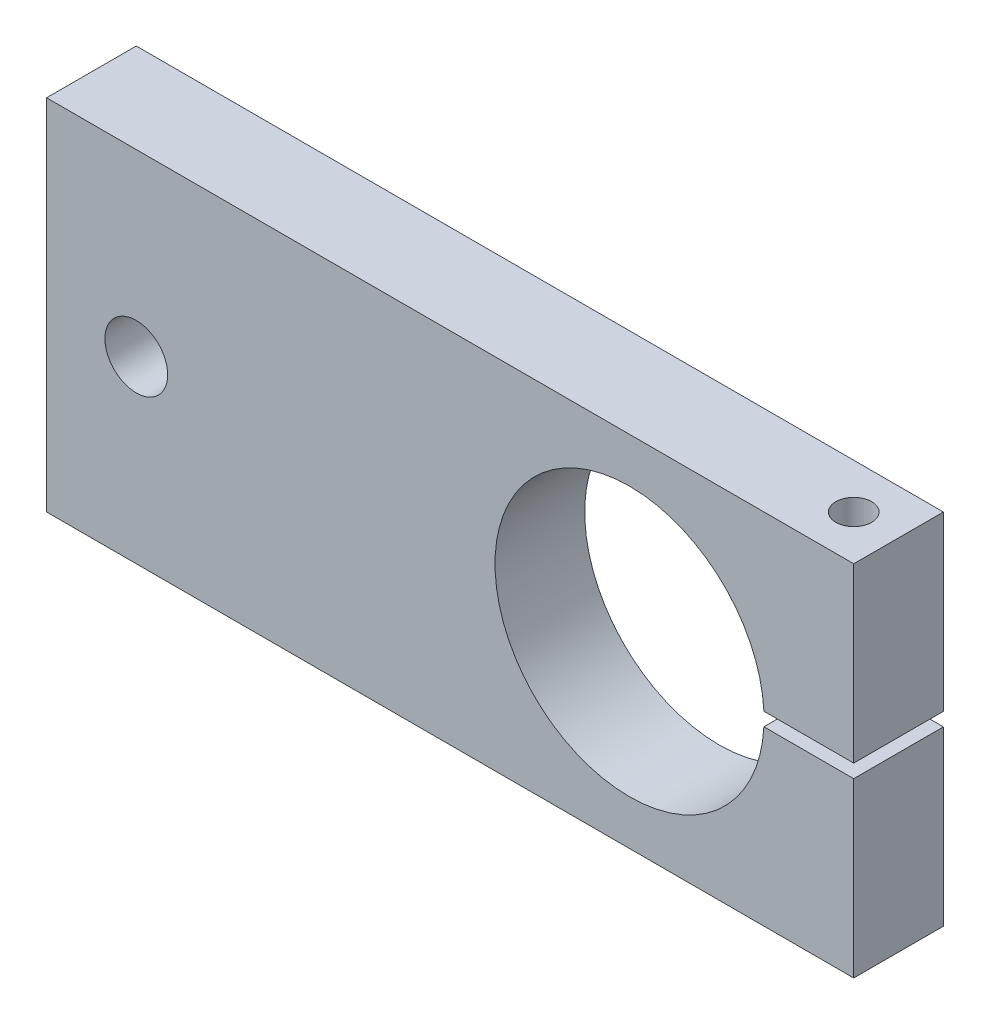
from build123d import *

# Parameters (mm, degrees)
SKETCH_1_W          = 180
SKETCH_1_H          = 80
SKETCH_1_R          = 30
SKETCH_1_R_2        = 7
EXTRUDE_1_DEPTH     = 20
SKETCH_2_R          = 4.5
CUT_EXTRUDE_1_DEPTH = 40
SKETCH_3_R          = 7
CUT_EXTRUDE_2_DEPTH = 10
SKETCH_4_R          = 4
CUT_EXTRUDE_3_DEPTH = 40
CUT_EXTRUDE_START   = -20
CUT_EXTRUDE_4_DEPTH = 20


with BuildPart() as part:
    # Sketch 1 → Extrude 1 (new body)
    with BuildSketch(Plane.XY):
        with Locations((-40, 0)):
            Rectangle(SKETCH_1_W, SKETCH_1_H)
        Circle(SKETCH_1_R, mode=Mode.SUBTRACT)
        with Locations((-110, 0)):
            Circle(SKETCH_1_R_2, mode=Mode.SUBTRACT)
    extrude(amount=EXTRUDE_1_DEPTH)

    # Sketch 2 → Cut-Extrude 1 (cut)
    with BuildSketch(Plane.XZ.offset(40)):
        with Locations(Location((40, 10, 0), (0, 0, 270))):
            Circle(SKETCH_2_R)
    extrude(amount=-CUT_EXTRUDE_1_DEPTH, mode=Mode.SUBTRACT)

    # Sketch 3 → Cut-Extrude 2 (cut)
    with BuildSketch(Plane.XZ.offset(40)):
        with Locations(Location((40, 10, 0), (0, 0, 270))):
            Circle(SKETCH_3_R)
    extrude(amount=-CUT_EXTRUDE_2_DEPTH, mode=Mode.SUBTRACT)

    # Sketch 4 → Cut-Extrude 3 (cut)
    with BuildSketch(Plane(origin=(0, 40, 0), x_dir=(1, 0, 0), z_dir=(0, 1, 0))):
        with Locations(Location((40, -10, 0), (0, 0, 180))):
            Circle(SKETCH_4_R)
    extrude(amount=-CUT_EXTRUDE_3_DEPTH, mode=Mode.SUBTRACT)

    # Sketch 5 → Cut-Extrude 4 (cut)
    with BuildSketch(Plane.XY.offset(20).offset(CUT_EXTRUDE_START)):
        with BuildLine():
            Line((29.962476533, -1.5), (67.784800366, -1.5))
            Line((67.784800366, -1.5), (67.784800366, 1.5))
            Line((67.784800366, 1.5), (29.962476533, 1.5))
            ThreePointArc((29.962476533, 1.5), (30, 0), (29.962476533, -1.5))
        make_face()
    extrude(amount=CUT_EXTRUDE_4_DEPTH, mode=Mode.SUBTRACT)


solid = part.part
